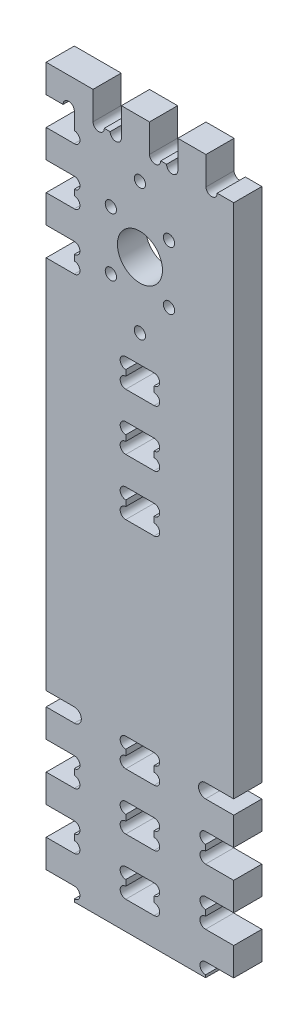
from build123d import *

# Parameters (mm, degrees)
AUFSATZ_LINEAR_AUSTRAGEN1_DEPTH = 15
SKIZZE2_R                       = 5.05
SCHNITT_LINEAR_AUSTRAGEN2_DEPTH = 7.5
SKIZZE3_R                       = 12
SKIZZE3_R_2                     = 3
SCHNITT_LINEAR_AUSTRAGEN3_DEPTH = 17.5
SCHNITT_LINEAR_AUSTRAGEN5_DEPTH = 17.5


with BuildPart() as part:
    # Skizze1 → Aufsatz-Linear austragen1 (new body)
    with BuildSketch(Plane.XY):
        with BuildLine():
            Line((0, 82.6), (15, 82.6))
            ThreePointArc((15, 82.6), (18.75, 86.35), (15, 90.1))
            Line((15, 90.1), (0, 90.1))
            Line((0, 90.1), (0, 289.970539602))
            Line((0, 289.970539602), (15, 289.970539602))
            ThreePointArc((15, 289.970539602), (18, 292.970539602), (15, 295.970539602))
            Line((15, 295.970539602), (15, 299.070539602))
            ThreePointArc((15, 299.070539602), (18, 302.070539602), (15, 305.070539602))
            Line((15, 305.070539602), (0, 305.070539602))
            Line((0, 305.070539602), (0, 320.070539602))
            Line((0, 320.070539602), (15, 320.070539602))
            ThreePointArc((15, 320.070539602), (18, 323.070539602), (15, 326.070539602))
            Line((15, 326.070539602), (15, 329.170539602))
            ThreePointArc((15, 329.170539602), (18, 332.170539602), (15, 335.170539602))
            Line((15, 335.170539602), (0, 335.170539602))
            Line((0, 335.170539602), (0, 350.170539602))
            Line((0, 350.170539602), (15, 350.170539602))
            ThreePointArc((15, 350.170539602), (18, 353.170539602), (15, 356.170539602))
            Line((15, 356.170539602), (15, 365.270539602))
            ThreePointArc((15, 365.270539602), (12, 368.270539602), (9, 365.270539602))
            Line((9, 365.270539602), (0, 365.270539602))
            Line((0, 365.270539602), (0, 380.270539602))
            Line((0, 380.270539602), (25, 380.270539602))
            Line((25, 380.270539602), (25, 365.270539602))
            ThreePointArc((25, 365.270539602), (27.999984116, 362.270539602), (31, 365.270507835))
            Line((31, 365.270507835), (34.1, 365.270507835))
            ThreePointArc((34.1, 365.270507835), (37.100015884, 362.270539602), (40.1, 365.270539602))
            Line((40.1, 365.270539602), (40.1, 380.270539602))
            Line((40.1, 380.270539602), (55.1, 380.270539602))
            Line((55.1, 380.270539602), (55.1, 365.270539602))
            ThreePointArc((55.1, 365.270539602), (58.099988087, 362.270539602), (61.1, 365.270515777))
            Line((61.1, 365.270515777), (64.2, 365.270515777))
            ThreePointArc((64.2, 365.270515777), (67.200009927, 362.270535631), (70.2, 365.270535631))
            Line((70.2, 365.270535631), (70.2, 380.270535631))
            Line((70.2, 380.270535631), (85.2, 380.270535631))
            Line((85.2, 380.270535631), (85.2, 365.270535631))
            ThreePointArc((85.2, 365.270535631), (88.264732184, 362.335267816), (91.2, 365.4))
            Line((91.2, 365.4), (100, 365.4))
            Line((100, 365.4), (100, 90.1))
            Line((100, 90.1), (85, 90.1))
            ThreePointArc((85, 90.1), (81.25, 86.35), (85, 82.6))
            Line((85, 82.6), (100, 82.6))
            Line((100, 82.6), (100, 67.6))
            Line((100, 67.6), (85, 67.6))
            ThreePointArc((85, 67.6), (82, 64.6), (85, 61.6))
            Line((85, 61.6), (85, 58.5))
            ThreePointArc((85, 58.5), (82, 55.5), (85, 52.5))
            Line((85, 52.5), (100, 52.5))
            Line((100, 52.5), (100, 37.5))
            Line((100, 37.5), (85, 37.5))
            ThreePointArc((85, 37.5), (82, 34.5), (85, 31.5))
            Line((85, 31.5), (85, 28.4))
            ThreePointArc((85, 28.4), (82, 25.4), (85, 22.4))
            Line((85, 22.4), (100, 22.4))
            Line((100, 22.4), (100, 7.4))
            Line((100, 7.4), (85, 7.4))
            ThreePointArc((85, 7.4), (82, 4.4), (85, 1.4))
            Line((85, 1.4), (85, 0))
            Line((85, 0), (15, 0))
            Line((15, 0), (15, 1.4))
            ThreePointArc((15, 1.4), (18, 4.4), (15, 7.4))
            Line((15, 7.4), (0, 7.4))
            Line((0, 7.4), (0, 22.4))
            Line((0, 22.4), (15, 22.4))
            ThreePointArc((15, 22.4), (18, 25.4), (15, 28.4))
            Line((15, 28.4), (15, 31.5))
            ThreePointArc((15, 31.5), (18, 34.5), (15, 37.5))
            Line((15, 37.5), (0, 37.5))
            Line((0, 37.5), (0, 52.5))
            Line((0, 52.5), (15, 52.5))
            ThreePointArc((15, 52.5), (18, 55.5), (15, 58.5))
            Line((15, 58.5), (15, 61.6))
            ThreePointArc((15, 61.6), (18, 64.6), (15, 67.6))
            Line((15, 67.6), (0, 67.6))
            Line((0, 67.6), (0, 82.6))
        make_face()
    extrude(amount=AUFSATZ_LINEAR_AUSTRAGEN1_DEPTH)

    # Skizze2 → Schnitt-Linear austragen2 (cut)
    with BuildSketch(Plane(origin=(0, 0, 0), x_dir=(-1, 0, 0), z_dir=(0, 0, -1))):
        with Locations((-50, 350.270515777)):
            Circle(SKIZZE2_R)
        with Locations((-50, 280.270515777)):
            Circle(SKIZZE2_R)
    extrude(amount=-SCHNITT_LINEAR_AUSTRAGEN2_DEPTH, mode=Mode.SUBTRACT)

    # Skizze3 → Schnitt-Linear austragen3 (cut)
    with BuildSketch(Plane(origin=(0, 0, 0), x_dir=(-1, 0, 0), z_dir=(0, 0, -1))):
        with Locations((-50, 315.270515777)):
            Circle(SKIZZE3_R)
        with Locations((-50, 350.270515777)):
            Circle(SKIZZE3_R_2)
        with Locations((-65.5, 330.770515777)):
            Circle(SKIZZE3_R_2)
        with Locations((-34.5, 330.770539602)):
            Circle(SKIZZE3_R_2)
        with Locations((-34.5, 299.770539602)):
            Circle(SKIZZE3_R_2)
        with Locations((-65.5, 299.770515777)):
            Circle(SKIZZE3_R_2)
        with Locations((-50, 280.270515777)):
            Circle(SKIZZE3_R_2)
    extrude(amount=-SCHNITT_LINEAR_AUSTRAGEN3_DEPTH, mode=Mode.SUBTRACT)

    # Skizze5 → Schnitt-Linear austragen5 (cut)
    with BuildSketch(Plane.XY.offset(15)):
        with BuildLine():
            ThreePointArc((42.45, 51.1), (39.45, 48.1), (42.45, 45.1))
            Line((42.45, 45.1), (57.55, 45.1))
            ThreePointArc((57.55, 45.1), (60.55, 48.1), (57.55, 51.1))
            Line((57.55, 51.1), (57.55, 54.2))
            ThreePointArc((57.55, 54.2), (60.55, 57.2), (57.55, 60.2))
            Line((57.55, 60.2), (42.45, 60.2))
            ThreePointArc((42.45, 60.2), (39.45, 57.2), (42.45, 54.2))
            Line((42.45, 54.2), (42.45, 51.1))
        make_face()
        with BuildLine():
            ThreePointArc((42.45, 21), (39.45, 18), (42.45, 15))
            Line((42.45, 15), (57.55, 15))
            ThreePointArc((57.55, 15), (60.55, 18), (57.55, 21))
            Line((57.55, 21), (57.55, 24.1))
            ThreePointArc((57.55, 24.1), (60.55, 27.1), (57.55, 30.1))
            Line((57.55, 30.1), (42.45, 30.1))
            ThreePointArc((42.45, 30.1), (39.45, 27.1), (42.45, 24.1))
            Line((42.45, 24.1), (42.45, 21))
        make_face()
        with BuildLine():
            ThreePointArc((42.45, 81.2), (39.45, 78.2), (42.45, 75.2))
            Line((42.45, 75.2), (57.55, 75.2))
            ThreePointArc((57.55, 75.2), (60.55, 78.2), (57.55, 81.2))
            Line((57.55, 81.2), (57.55, 84.3))
            ThreePointArc((57.55, 84.3), (60.55, 87.3), (57.55, 90.3))
            Line((57.55, 90.3), (42.45, 90.3))
            ThreePointArc((42.45, 90.3), (39.45, 87.3), (42.45, 84.3))
            Line((42.45, 84.3), (42.45, 81.2))
        make_face()
        with BuildLine():
            ThreePointArc((42.45, 226.4), (39.45, 223.4), (42.45, 220.4))
            Line((42.45, 220.4), (57.55, 220.4))
            ThreePointArc((57.55, 220.4), (60.55, 223.4), (57.55, 226.4))
            Line((57.55, 226.4), (57.55, 229.5))
            ThreePointArc((57.55, 229.5), (60.55, 232.5), (57.55, 235.5))
            Line((57.55, 235.5), (42.45, 235.5))
            ThreePointArc((42.45, 235.5), (39.45, 232.5), (42.45, 229.5))
            Line((42.45, 229.5), (42.45, 226.4))
        make_face()
        with BuildLine():
            ThreePointArc((42.45, 196.3), (39.45, 193.3), (42.45, 190.3))
            Line((42.45, 190.3), (57.55, 190.3))
            ThreePointArc((57.55, 190.3), (60.55, 193.3), (57.55, 196.3))
            Line((57.55, 196.3), (57.55, 199.4))
            ThreePointArc((57.55, 199.4), (60.55, 202.4), (57.55, 205.4))
            Line((57.55, 205.4), (42.45, 205.4))
            ThreePointArc((42.45, 205.4), (39.45, 202.4), (42.45, 199.4))
            Line((42.45, 199.4), (42.45, 196.3))
        make_face()
        with BuildLine():
            ThreePointArc((42.45, 256.5), (39.45, 253.5), (42.45, 250.5))
            Line((42.45, 250.5), (57.55, 250.5))
            ThreePointArc((57.55, 250.5), (60.55, 253.5), (57.55, 256.5))
            Line((57.55, 256.5), (57.55, 259.6))
            ThreePointArc((57.55, 259.6), (60.55, 262.6), (57.55, 265.6))
            Line((57.55, 265.6), (42.45, 265.6))
            ThreePointArc((42.45, 265.6), (39.45, 262.6), (42.45, 259.6))
            Line((42.45, 259.6), (42.45, 256.5))
        make_face()
    extrude(amount=-SCHNITT_LINEAR_AUSTRAGEN5_DEPTH, mode=Mode.SUBTRACT)


solid = part.part
